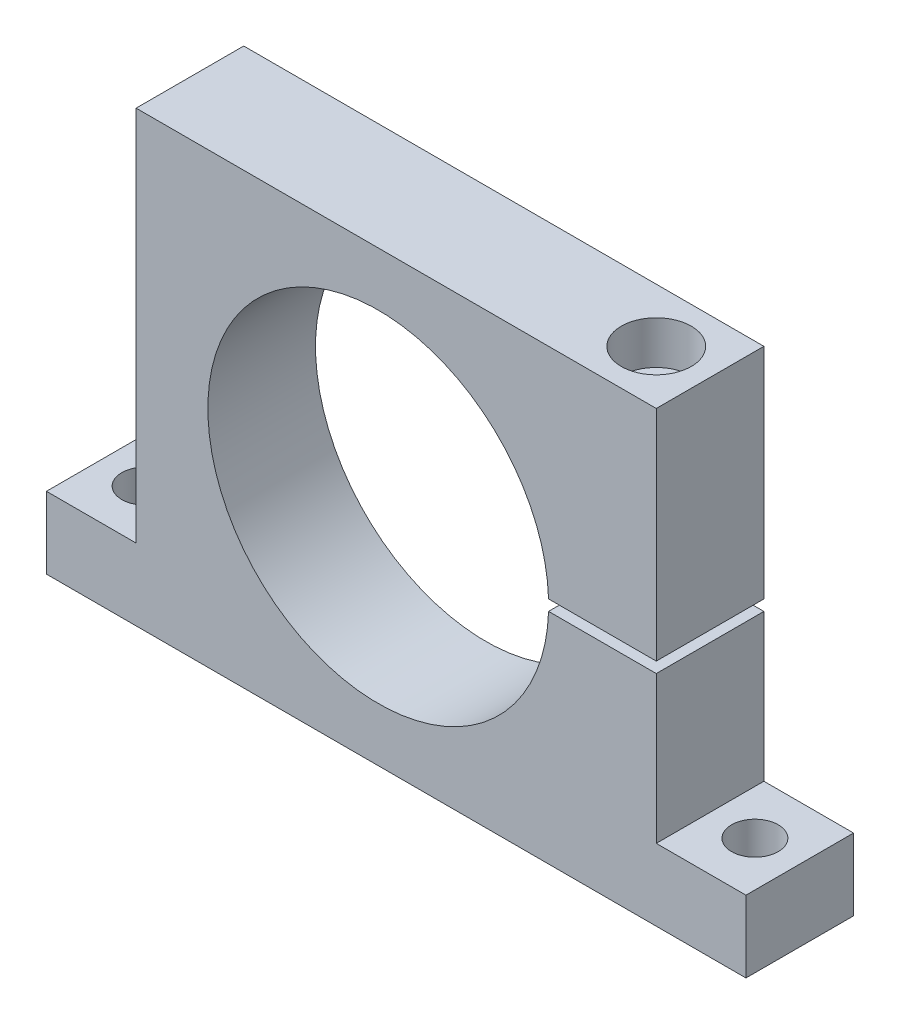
from build123d import *

# Parameters (mm, degrees)
BOSS_EXTRUDE1_DEPTH = 15
SKETCH2_R           = 6.5
CUT_EXTRUDE1_DEPTH  = 20


with BuildPart() as part:
    # Sketch1 → Boss-Extrude1 (new, symmetric)
    with BuildSketch(Plane.XY):
        with BuildLine():
            Line((-67.5, 62.5), (77.5, 62.5))
            Line((77.5, 62.5), (77.5, 1.5))
            Line((77.5, 1.5), (47.476309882, 1.5))
            ThreePointArc((47.476309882, 1.5), (-47.5, 0), (47.476309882, -1.5))
            Line((47.476309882, -1.5), (77.5, -1.5))
            Line((77.5, -1.5), (77.5, -42.5))
            Line((77.5, -42.5), (102.5, -42.5))
            Line((102.5, -42.5), (102.5, -62.5))
            Line((102.5, -62.5), (-92.5, -62.5))
            Line((-92.5, -62.5), (-92.5, -42.5))
            Line((-92.5, -42.5), (-67.5, -42.5))
            Line((-67.5, -42.5), (-67.5, 62.5))
        make_face()
    extrude(amount=BOSS_EXTRUDE1_DEPTH, both=True)

    # Sketch2 → Cut-Extrude1 (cut)
    with BuildSketch(Plane.XZ.offset(62.5)):
        with Locations((-80, 0)):
            Circle(SKETCH2_R)
        with Locations((90, 0)):
            Circle(SKETCH2_R)
    extrude(amount=-CUT_EXTRUDE1_DEPTH, mode=Mode.SUBTRACT)

    # Sketch3 → Cut-Revolve1 (revolve, cut)
    with BuildSketch(Plane.XY, mode=Mode.PRIVATE) as cut_revolve1_sk:
        Polygon((62.5, 62.5), (72.25, 62.5), (72.25, 50.5), (68.5, 50.5), (68.5, -47.5), (62.5, -51.105163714), align=None)
    revolve(cut_revolve1_sk.sketch.rotate(Axis((62.5, 62.5, 0), (0, -1, 0)), 180), axis=Axis((62.5, 62.5, 0), (0, -1, 0)), mode=Mode.SUBTRACT)


solid = part.part
